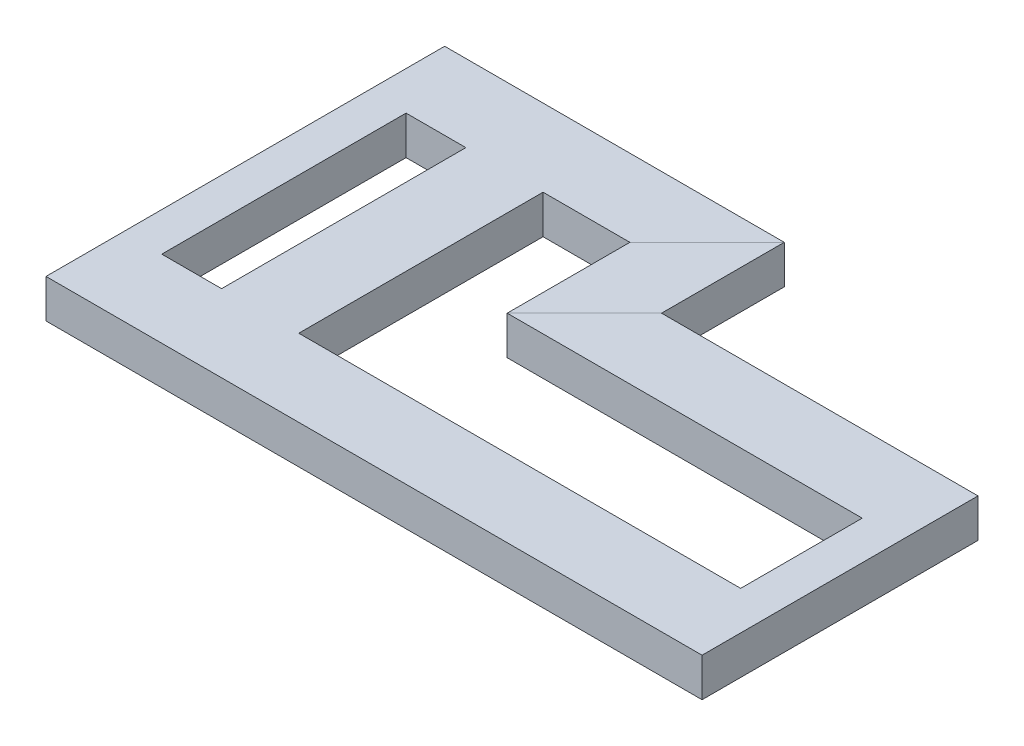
from build123d import *

# Parameters (mm, degrees)
BOSS_EXTRUDE1_DEPTH = 1700
SKETCH12_W          = 100
SKETCH12_H          = 100
SKETCH12_W_2        = 80
SKETCH12_H_2        = 80
BOSS_EXTRUDE2_DEPTH = 633
SKETCH13_W          = 100
SKETCH13_H          = 100
SKETCH13_W_2        = 80
SKETCH13_H_2        = 80
BOSS_EXTRUDE3_DEPTH = 315
SKETCH14_W          = 180
SKETCH14_H          = 90
BOSS_EXTRUDE4_DEPTH = 5
SKETCH15_W          = 180
SKETCH15_H          = 90
BOSS_EXTRUDE5_DEPTH = 5
BOSS_EXTRUDE6_REACH = 1897.756


with BuildPart() as part:
    # Sketch8 → Boss-Extrude1 (new body)
    with BuildSketch(Plane(origin=(0, 0, 0), x_dir=(0, 0, -1), z_dir=(1, 0, 0))):
        Polygon((-90, -100), (-90, -10), (90, -10), (90, -100), (100, -100), (100, 0), (-100, 0), (-100, -100), align=None)
    extrude(amount=-BOSS_EXTRUDE1_DEPTH)



with BuildPart() as body_2:
    # Sweep1: sweep along a path in Sketch10
    with BuildLine(Plane(origin=(0, 0, 0), x_dir=(1, 0, 0), z_dir=(0, 1, 0))) as sweep1_path:
        Line((0, 615), (-820, 615))
        Line((-820, 615), (-820, 933))
        Line((-820, 933), (-1700, 933))
    # Sketch9 → Sweep1 (sweep)
    with BuildSketch(Plane(origin=(0, 0, 0), x_dir=(0, 0, -1), z_dir=(1, 0, 0))):
        Polygon((415, -100), (415, 0), (615, 0), (615, -100), (605, -100), (605, -10), (425, -10), (425, -100), align=None)
    sweep(path=sweep1_path.line, transition=Transition.RIGHT)


with BuildPart() as part_1:
    add(part.part)

    add(body_2.part)  # Boss-Extrude2 merges body 2
    # Sketch12 → Boss-Extrude2 (add)
    with BuildSketch(Plane(origin=(0, 0, -733), x_dir=(-1, 0, 0), z_dir=(0, 0, -1))):
        with Locations((1650, -50)):
            Rectangle(SKETCH12_W, SKETCH12_H)
        with Locations((1650, -50)):
            Rectangle(SKETCH12_W_2, SKETCH12_H_2, mode=Mode.SUBTRACT)
    extrude(amount=-BOSS_EXTRUDE2_DEPTH)

    # Sketch13 → Boss-Extrude3 (add)
    with BuildSketch(Plane.XY.offset(-415)):
        with Locations((-50, -50)):
            Rectangle(SKETCH13_W, SKETCH13_H)
        with Locations((-50, -50)):
            Rectangle(SKETCH13_W_2, SKETCH13_H_2, mode=Mode.SUBTRACT)
    extrude(amount=BOSS_EXTRUDE3_DEPTH)

    # Sketch14 → Boss-Extrude4 (add)
    with BuildSketch(Plane.ZY.offset(1700)):
        with Locations((0, -55)):
            Rectangle(SKETCH14_W, SKETCH14_H)
        with Locations((-833, -55)):
            Rectangle(SKETCH14_W, SKETCH14_H)
    extrude(amount=-BOSS_EXTRUDE4_DEPTH)

    # Sketch15 → Boss-Extrude5 (add)
    with BuildSketch(Plane(origin=(0, 0, 0), x_dir=(0, 0, -1), z_dir=(1, 0, 0))):
        with Locations((515, -55)):
            Rectangle(SKETCH15_W, SKETCH15_H)
        with Locations((0, -55)):
            Rectangle(SKETCH15_W, SKETCH15_H)
    extrude(amount=-BOSS_EXTRUDE5_DEPTH)

    # Sketch16 → Boss-Extrude6 (add, up to next)
    with BuildSketch(Plane(origin=(0, 0, -100), x_dir=(-1, 0, 0), z_dir=(0, 0, -1)), mode=Mode.PRIVATE) as boss_extrude6_sk1:
        Polygon((1445, -100), (1445, 0), (1245, 0), (1245, -100), (1255, -100), (1255, -10), (1435, -10), (1435, -100), align=None)
    boss_extrude6_tool1 = extrude(boss_extrude6_sk1.sketch, amount=BOSS_EXTRUDE6_REACH, mode=Mode.PRIVATE) - part_1.part
    add(boss_extrude6_tool1.solids().sort_by_distance((-1442.763932, -50, -100))[0])


solid = part_1.part
